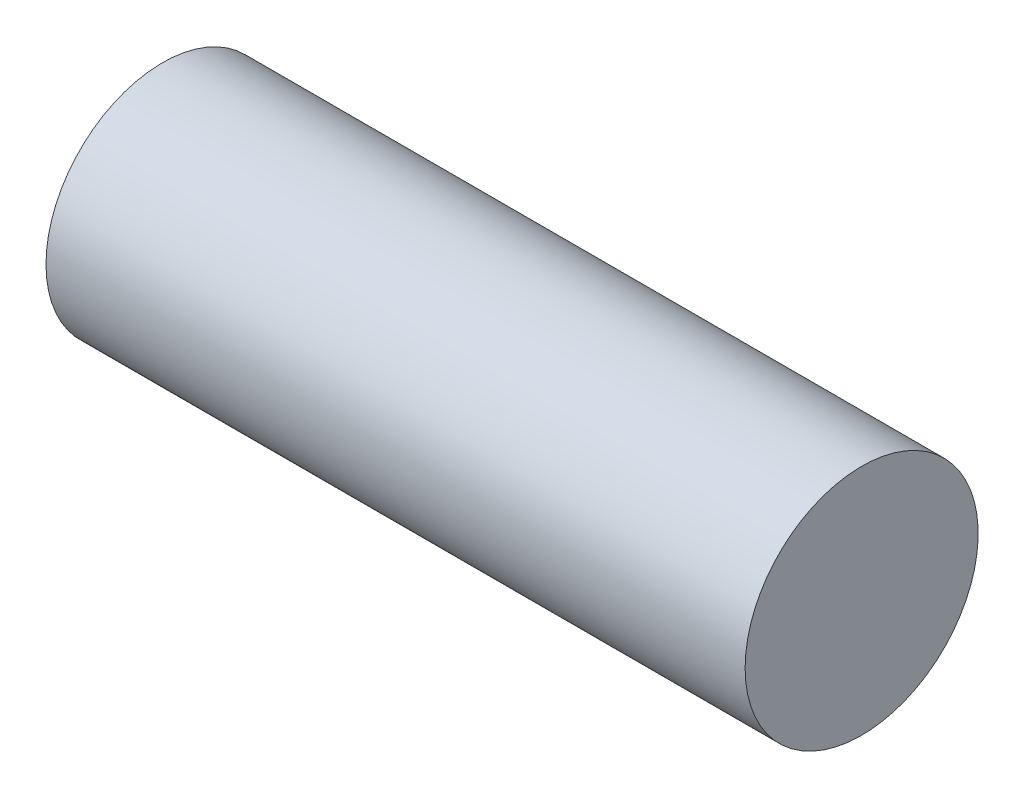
from build123d import *

# Parameters (mm, degrees)
SKETCH1_R          = 3.175
BASE_EXTRUDE_DEPTH = 9.525


with BuildPart() as part:
    # Sketch1 → Base-Extrude (new, symmetric)
    with BuildSketch(Plane(origin=(0, 0, 0), x_dir=(0, 0, -1), z_dir=(1, 0, 0))):
        with Locations(Location((0, 0, 0), (0, 0, 180))):
            Circle(SKETCH1_R)
    extrude(amount=BASE_EXTRUDE_DEPTH, both=True)


solid = part.part
